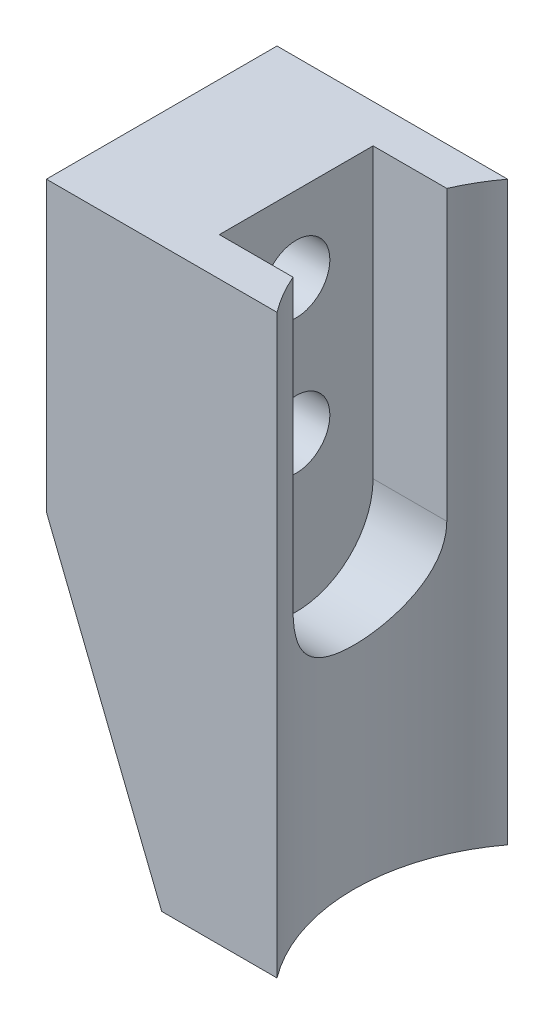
ISO-10303-21;
HEADER;
FILE_DESCRIPTION(('STEP AP214'),'2;1');
FILE_NAME('part.step','',(''),(''),'','','');
FILE_SCHEMA(('AUTOMOTIVE_DESIGN { 1 0 10303 214 1 1 1 1 }'));
ENDSEC;
DATA;
#1=APPLICATION_CONTEXT('core data for automotive mechanical design processes');
#2=APPLICATION_PROTOCOL_DEFINITION('international standard','automotive_design',2000,#1);
#3=PRODUCT_CONTEXT('',#1,'mechanical');
#4=PRODUCT('Part','Part','',(#3));
#5=PRODUCT_RELATED_PRODUCT_CATEGORY('part','',(#4));
#6=PRODUCT_DEFINITION_FORMATION('','',#4);
#7=PRODUCT_DEFINITION_CONTEXT('part definition',#1,'design');
#8=PRODUCT_DEFINITION('design','',#6,#7);
#9=PRODUCT_DEFINITION_SHAPE('','',#8);
#10=(LENGTH_UNIT() NAMED_UNIT(*) SI_UNIT(.MILLI.,.METRE.));
#11=(NAMED_UNIT(*) PLANE_ANGLE_UNIT() SI_UNIT($,.RADIAN.));
#12=(NAMED_UNIT(*) SI_UNIT($,.STERADIAN.) SOLID_ANGLE_UNIT());
#13=UNCERTAINTY_MEASURE_WITH_UNIT(LENGTH_MEASURE(1.E-05),#10,'distance_accuracy_value','');
#14=(GEOMETRIC_REPRESENTATION_CONTEXT(3) GLOBAL_UNCERTAINTY_ASSIGNED_CONTEXT((#13)) GLOBAL_UNIT_ASSIGNED_CONTEXT((#10,
#11,#12)) REPRESENTATION_CONTEXT('',''));
#15=CARTESIAN_POINT('',(0.,0.,0.));
#16=DIRECTION('',(0.,0.,1.));
#17=DIRECTION('',(1.,0.,0.));
#18=AXIS2_PLACEMENT_3D('',#15,#16,#17);
#19=CARTESIAN_POINT('',(-20.,3.99999999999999,6.));
#20=DIRECTION('',(1.,0.,0.));
#21=DIRECTION('',(0.,1.,0.));
#22=AXIS2_PLACEMENT_3D('',#19,#20,#21);
#23=CYLINDRICAL_SURFACE('',#22,1.75);
#24=CARTESIAN_POINT('',(-12.5,3.99999999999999,6.));
#25=DIRECTION('',(1.,0.,0.));
#26=DIRECTION('',(0.,1.,0.));
#27=AXIS2_PLACEMENT_3D('',#24,#25,#26);
#28=CIRCLE('',#27,1.75);
#29=CARTESIAN_POINT('',(-12.5,5.74999999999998,6.));
#30=VERTEX_POINT('',#29);
#31=EDGE_CURVE('E105',#30,#30,#28,.F.);
#32=ORIENTED_EDGE('',*,*,#31,.F.);
#33=EDGE_LOOP('',(#32));
#34=FACE_BOUND('',#33,.T.);
#35=CARTESIAN_POINT('',(-16.5,3.99999999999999,6.));
#36=DIRECTION('',(1.,0.,0.));
#37=DIRECTION('',(0.,1.,0.));
#38=AXIS2_PLACEMENT_3D('',#35,#36,#37);
#39=CIRCLE('',#38,1.75);
#40=CARTESIAN_POINT('',(-16.5,5.74999999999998,6.));
#41=VERTEX_POINT('',#40);
#42=EDGE_CURVE('E20',#41,#41,#39,.T.);
#43=ORIENTED_EDGE('',*,*,#42,.F.);
#44=EDGE_LOOP('',(#43));
#45=FACE_BOUND('',#44,.T.);
#46=ADVANCED_FACE('F17',(#34,#45),#23,.F.);
#47=CARTESIAN_POINT('',(-20.,11.,6.));
#48=DIRECTION('',(1.,0.,0.));
#49=DIRECTION('',(0.,1.,0.));
#50=AXIS2_PLACEMENT_3D('',#47,#48,#49);
#51=CYLINDRICAL_SURFACE('',#50,1.75);
#52=CARTESIAN_POINT('',(-12.5,11.,6.));
#53=DIRECTION('',(1.,0.,0.));
#54=DIRECTION('',(0.,1.,0.));
#55=AXIS2_PLACEMENT_3D('',#52,#53,#54);
#56=CIRCLE('',#55,1.75);
#57=CARTESIAN_POINT('',(-12.5,12.75,6.));
#58=VERTEX_POINT('',#57);
#59=EDGE_CURVE('E96',#58,#58,#56,.F.);
#60=ORIENTED_EDGE('',*,*,#59,.F.);
#61=EDGE_LOOP('',(#60));
#62=FACE_BOUND('',#61,.T.);
#63=CARTESIAN_POINT('',(-16.5,11.,6.));
#64=DIRECTION('',(1.,0.,0.));
#65=DIRECTION('',(0.,1.,0.));
#66=AXIS2_PLACEMENT_3D('',#63,#64,#65);
#67=CIRCLE('',#66,1.75);
#68=CARTESIAN_POINT('',(-16.5,12.75,6.));
#69=VERTEX_POINT('',#68);
#70=EDGE_CURVE('E106',#69,#69,#67,.T.);
#71=ORIENTED_EDGE('',*,*,#70,.F.);
#72=EDGE_LOOP('',(#71));
#73=FACE_BOUND('',#72,.T.);
#74=ADVANCED_FACE('F301',(#62,#73),#51,.F.);
#75=CARTESIAN_POINT('',(-16.5,3.99999999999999,6.));
#76=DIRECTION('',(-1.,0.,0.));
#77=DIRECTION('',(0.,-1.,0.));
#78=AXIS2_PLACEMENT_3D('',#75,#76,#77);
#79=PLANE('',#78);
#80=ORIENTED_EDGE('',*,*,#42,.T.);
#81=EDGE_LOOP('',(#80));
#82=FACE_BOUND('',#81,.T.);
#83=CARTESIAN_POINT('',(-16.5,3.99999999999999,6.));
#84=DIRECTION('',(-1.,0.,0.));
#85=DIRECTION('',(0.,-1.,0.));
#86=AXIS2_PLACEMENT_3D('',#83,#84,#85);
#87=CIRCLE('',#86,3.);
#88=CARTESIAN_POINT('',(-16.5,0.999999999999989,6.));
#89=VERTEX_POINT('',#88);
#90=EDGE_CURVE('E122',#89,#89,#87,.T.);
#91=ORIENTED_EDGE('',*,*,#90,.T.);
#92=EDGE_LOOP('',(#91));
#93=FACE_BOUND('',#92,.T.);
#94=ADVANCED_FACE('F298',(#82,#93),#79,.T.);
#95=CARTESIAN_POINT('',(-16.5,11.,6.));
#96=DIRECTION('',(-1.,0.,0.));
#97=DIRECTION('',(0.,-1.,0.));
#98=AXIS2_PLACEMENT_3D('',#95,#96,#97);
#99=PLANE('',#98);
#100=ORIENTED_EDGE('',*,*,#70,.T.);
#101=EDGE_LOOP('',(#100));
#102=FACE_BOUND('',#101,.T.);
#103=CARTESIAN_POINT('',(-16.5,11.,6.));
#104=DIRECTION('',(-1.,0.,0.));
#105=DIRECTION('',(0.,-1.,0.));
#106=AXIS2_PLACEMENT_3D('',#103,#104,#105);
#107=CIRCLE('',#106,3.);
#108=CARTESIAN_POINT('',(-16.5,7.99999999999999,6.));
#109=VERTEX_POINT('',#108);
#110=EDGE_CURVE('E150',#109,#109,#107,.T.);
#111=ORIENTED_EDGE('',*,*,#110,.T.);
#112=EDGE_LOOP('',(#111));
#113=FACE_BOUND('',#112,.T.);
#114=ADVANCED_FACE('F185',(#102,#113),#99,.T.);
#115=CARTESIAN_POINT('',(-12.5,0.,6.));
#116=DIRECTION('',(1.,0.,0.));
#117=DIRECTION('',(0.,1.,0.));
#118=AXIS2_PLACEMENT_3D('',#115,#116,#117);
#119=CYLINDRICAL_SURFACE('',#118,4.);
#120=CARTESIAN_POINT('',(-12.5,0.,6.));
#121=DIRECTION('',(1.,0.,0.));
#122=DIRECTION('',(0.,1.,0.));
#123=AXIS2_PLACEMENT_3D('',#120,#121,#122);
#124=CIRCLE('',#123,4.);
#125=CARTESIAN_POINT('',(-12.5,0.,10.));
#126=VERTEX_POINT('',#125);
#127=CARTESIAN_POINT('',(-12.5,0.,2.));
#128=VERTEX_POINT('',#127);
#129=EDGE_CURVE('E85',#126,#128,#124,.T.);
#130=ORIENTED_EDGE('',*,*,#129,.F.);
#131=DIRECTION('',(1.,0.,0.));
#132=VECTOR('',#131,1.);
#133=CARTESIAN_POINT('',(-12.5,0.,10.));
#134=LINE('',#133,#132);
#135=CARTESIAN_POINT('',(-8.66515138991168,0.,10.));
#136=VERTEX_POINT('',#135);
#137=EDGE_CURVE('E113',#126,#136,#134,.T.);
#138=ORIENTED_EDGE('',*,*,#137,.T.);
#139=CARTESIAN_POINT('',(-8.66515138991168,0.,10.));
#140=CARTESIAN_POINT('',(-8.66512928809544,-0.107611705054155,10.0000159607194));
#141=CARTESIAN_POINT('',(-8.66704612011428,-0.215211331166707,9.99565782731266));
#142=CARTESIAN_POINT('',(-8.67459250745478,-0.429542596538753,9.9783181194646));
#143=CARTESIAN_POINT('',(-8.68022064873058,-0.536274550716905,9.96533982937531));
#144=CARTESIAN_POINT('',(-8.69499565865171,-0.747693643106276,9.93095207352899));
#145=CARTESIAN_POINT('',(-8.70412861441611,-0.852387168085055,9.90957593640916));
#146=CARTESIAN_POINT('',(-8.72560106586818,-1.05940154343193,9.85863260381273));
#147=CARTESIAN_POINT('',(-8.73794075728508,-1.16172224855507,9.82906490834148));
#148=CARTESIAN_POINT('',(-8.7791858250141,-1.46387170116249,9.72853943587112));
#149=CARTESIAN_POINT('',(-8.8123489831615,-1.65930846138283,9.64568978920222));
#150=CARTESIAN_POINT('',(-8.88624741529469,-2.03359116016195,9.45096383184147));
#151=CARTESIAN_POINT('',(-8.92698987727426,-2.21242110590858,9.33905992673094));
#152=CARTESIAN_POINT('',(-9.01401998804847,-2.55852479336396,9.08263671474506));
#153=CARTESIAN_POINT('',(-9.06048491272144,-2.7247344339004,8.936738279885));
#154=CARTESIAN_POINT('',(-9.15225581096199,-3.03108054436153,8.61939292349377));
#155=CARTESIAN_POINT('',(-9.19756154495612,-3.1712116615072,8.44794076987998));
#156=CARTESIAN_POINT('',(-9.28406834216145,-3.42681278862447,8.07601181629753));
#157=CARTESIAN_POINT('',(-9.32503649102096,-3.54108961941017,7.87465586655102));
#158=CARTESIAN_POINT('',(-9.39607888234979,-3.73368814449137,7.45364828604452));
#159=CARTESIAN_POINT('',(-9.42615767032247,-3.81202484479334,7.23400433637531));
#160=CARTESIAN_POINT('',(-9.47076629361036,-3.92668240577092,6.79393488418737));
#161=CARTESIAN_POINT('',(-9.48597845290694,-3.96485391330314,6.57406211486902));
#162=CARTESIAN_POINT('',(-9.501606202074,-4.00405694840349,6.1305368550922));
#163=CARTESIAN_POINT('',(-9.5020270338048,-4.00510163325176,5.90688573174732));
#164=CARTESIAN_POINT('',(-9.48843920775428,-3.97103436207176,5.47553326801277));
#165=CARTESIAN_POINT('',(-9.47523973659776,-3.93795005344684,5.26764166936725));
#166=CARTESIAN_POINT('',(-9.43698538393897,-3.84001299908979,4.86065035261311));
#167=CARTESIAN_POINT('',(-9.41192983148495,-3.77515845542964,4.66155113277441));
#168=CARTESIAN_POINT('',(-9.35193670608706,-3.61472796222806,4.27420520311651));
#169=CARTESIAN_POINT('',(-9.31685584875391,-3.51870360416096,4.08616735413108));
#170=CARTESIAN_POINT('',(-9.24029168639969,-3.29906873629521,3.72838400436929));
#171=CARTESIAN_POINT('',(-9.19880613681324,-3.17544854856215,3.5586449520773));
#172=CARTESIAN_POINT('',(-9.11043706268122,-2.89471994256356,3.2304774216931));
#173=CARTESIAN_POINT('',(-9.06337795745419,-2.7359469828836,3.07352077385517));
#174=CARTESIAN_POINT('',(-8.97123359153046,-2.39400786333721,2.7877852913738));
#175=CARTESIAN_POINT('',(-8.92614923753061,-2.2108306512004,2.65901929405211));
#176=CARTESIAN_POINT('',(-8.86326134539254,-1.9183643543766,2.48813865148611));
#177=CARTESIAN_POINT('',(-8.84283170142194,-1.81632816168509,2.43428736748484));
#178=CARTESIAN_POINT('',(-8.80450957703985,-1.60760769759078,2.3354523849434));
#179=CARTESIAN_POINT('',(-8.78661600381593,-1.5009254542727,2.29046486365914));
#180=CARTESIAN_POINT('',(-8.7540025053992,-1.28377106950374,2.20983745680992));
#181=CARTESIAN_POINT('',(-8.7392786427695,-1.17330382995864,2.17418596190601));
#182=CARTESIAN_POINT('',(-8.7135146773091,-0.949331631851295,2.11255151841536));
#183=CARTESIAN_POINT('',(-8.70247292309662,-0.83582805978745,2.08656423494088));
#184=CARTESIAN_POINT('',(-8.68417798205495,-0.602554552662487,2.04380606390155));
#185=CARTESIAN_POINT('',(-8.67707470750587,-0.482705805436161,2.02739874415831));
#186=CARTESIAN_POINT('',(-8.66754485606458,-0.241909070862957,2.00548551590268));
#187=CARTESIAN_POINT('',(-8.66511539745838,-0.120961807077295,1.9999728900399));
#188=CARTESIAN_POINT('',(-8.66515138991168,0.,2.));
#189=B_SPLINE_CURVE_WITH_KNOTS('',3,(#139,#140,#141,#142,#143,#144,#145,#146,#147,#148,#149,
#150,#151,#152,#153,#154,#155,#156,#157,#158,#159,#160,#161,#162,#163,#164,#165,#166,#167,#168,
#169,#170,#171,#172,#173,#174,#175,#176,#177,#178,#179,#180,#181,#182,#183,#184,#185,#186,#187,
#188),.UNSPECIFIED.,.F.,.F.,(4,2,2,2,2,2,2,2,2,2,2,2,2,2,2,2,2,2,2,2,2,2,2,2,4),(0.,
0.322709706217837,0.645296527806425,0.966615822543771,1.28795473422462,1.9293660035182,
2.57138869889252,3.24636095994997,3.92147161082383,4.62325717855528,5.32474946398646,
5.9922775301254,6.65956903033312,7.28937830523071,7.91922322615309,8.55856353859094,
9.19812842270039,9.87963749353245,10.5614562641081,10.9125878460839,11.2635676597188,
11.614108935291,11.964492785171,12.3274303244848,12.6901440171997),.UNSPECIFIED.);
#190=CARTESIAN_POINT('',(-8.66515138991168,0.,2.));
#191=VERTEX_POINT('',#190);
#192=EDGE_CURVE('E102',#136,#191,#189,.T.);
#193=ORIENTED_EDGE('',*,*,#192,.T.);
#194=DIRECTION('',(1.,0.,0.));
#195=VECTOR('',#194,1.);
#196=CARTESIAN_POINT('',(-12.5,0.,2.));
#197=LINE('',#196,#195);
#198=EDGE_CURVE('E99',#191,#128,#197,.F.);
#199=ORIENTED_EDGE('',*,*,#198,.T.);
#200=EDGE_LOOP('',(#130,#138,#193,#199));
#201=FACE_BOUND('',#200,.T.);
#202=ADVANCED_FACE('F100',(#201),#119,.F.);
#203=CARTESIAN_POINT('',(-12.5,15.,2.));
#204=DIRECTION('',(0.,0.,-1.));
#205=DIRECTION('',(0.,1.,0.));
#206=AXIS2_PLACEMENT_3D('',#203,#204,#205);
#207=PLANE('',#206);
#208=DIRECTION('',(0.,-1.,0.));
#209=VECTOR('',#208,1.);
#210=CARTESIAN_POINT('',(-8.66515138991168,28.2842712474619,2.));
#211=LINE('',#210,#209);
#212=CARTESIAN_POINT('',(-8.66515138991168,15.,2.));
#213=VERTEX_POINT('',#212);
#214=EDGE_CURVE('E142',#191,#213,#211,.F.);
#215=ORIENTED_EDGE('',*,*,#214,.T.);
#216=DIRECTION('',(1.,0.,0.));
#217=VECTOR('',#216,1.);
#218=CARTESIAN_POINT('',(-20.,15.,2.));
#219=LINE('',#218,#217);
#220=CARTESIAN_POINT('',(-12.5,15.,2.));
#221=VERTEX_POINT('',#220);
#222=EDGE_CURVE('E111',#213,#221,#219,.F.);
#223=ORIENTED_EDGE('',*,*,#222,.T.);
#224=DIRECTION('',(0.,1.,0.));
#225=VECTOR('',#224,1.);
#226=CARTESIAN_POINT('',(-12.5,15.,2.));
#227=LINE('',#226,#225);
#228=EDGE_CURVE('E93',#128,#221,#227,.T.);
#229=ORIENTED_EDGE('',*,*,#228,.F.);
#230=ORIENTED_EDGE('',*,*,#198,.F.);
#231=EDGE_LOOP('',(#215,#223,#229,#230));
#232=FACE_BOUND('',#231,.T.);
#233=ADVANCED_FACE('F109',(#232),#207,.F.);
#234=CARTESIAN_POINT('',(-12.5,15.,6.));
#235=DIRECTION('',(1.,0.,0.));
#236=DIRECTION('',(0.,1.,0.));
#237=AXIS2_PLACEMENT_3D('',#234,#235,#236);
#238=PLANE('',#237);
#239=ORIENTED_EDGE('',*,*,#129,.T.);
#240=ORIENTED_EDGE('',*,*,#228,.T.);
#241=DIRECTION('',(0.,0.,-1.));
#242=VECTOR('',#241,1.);
#243=CARTESIAN_POINT('',(-12.5,15.,12.));
#244=LINE('',#243,#242);
#245=CARTESIAN_POINT('',(-12.5,15.,10.));
#246=VERTEX_POINT('',#245);
#247=EDGE_CURVE('E249',#221,#246,#244,.F.);
#248=ORIENTED_EDGE('',*,*,#247,.T.);
#249=DIRECTION('',(0.,-1.,0.));
#250=VECTOR('',#249,1.);
#251=CARTESIAN_POINT('',(-12.5,15.,10.));
#252=LINE('',#251,#250);
#253=EDGE_CURVE('E95',#246,#126,#252,.T.);
#254=ORIENTED_EDGE('',*,*,#253,.T.);
#255=EDGE_LOOP('',(#239,#240,#248,#254));
#256=FACE_BOUND('',#255,.T.);
#257=ORIENTED_EDGE('',*,*,#59,.T.);
#258=EDGE_LOOP('',(#257));
#259=FACE_BOUND('',#258,.T.);
#260=ORIENTED_EDGE('',*,*,#31,.T.);
#261=EDGE_LOOP('',(#260));
#262=FACE_BOUND('',#261,.T.);
#263=ADVANCED_FACE('F89',(#256,#259,#262),#238,.T.);
#264=CARTESIAN_POINT('',(-12.5,15.,10.));
#265=DIRECTION('',(0.,0.,1.));
#266=DIRECTION('',(0.,-1.,0.));
#267=AXIS2_PLACEMENT_3D('',#264,#265,#266);
#268=PLANE('',#267);
#269=DIRECTION('',(0.,-1.,0.));
#270=VECTOR('',#269,1.);
#271=CARTESIAN_POINT('',(-8.66515138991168,28.2842712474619,10.));
#272=LINE('',#271,#270);
#273=CARTESIAN_POINT('',(-8.66515138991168,15.,10.));
#274=VERTEX_POINT('',#273);
#275=EDGE_CURVE('E149',#274,#136,#272,.T.);
#276=ORIENTED_EDGE('',*,*,#275,.T.);
#277=ORIENTED_EDGE('',*,*,#137,.F.);
#278=ORIENTED_EDGE('',*,*,#253,.F.);
#279=DIRECTION('',(1.,0.,0.));
#280=VECTOR('',#279,1.);
#281=CARTESIAN_POINT('',(-20.,15.,10.));
#282=LINE('',#281,#280);
#283=EDGE_CURVE('E138',#246,#274,#282,.T.);
#284=ORIENTED_EDGE('',*,*,#283,.T.);
#285=EDGE_LOOP('',(#276,#277,#278,#284));
#286=FACE_BOUND('',#285,.T.);
#287=ADVANCED_FACE('F174',(#286),#268,.F.);
#288=CARTESIAN_POINT('',(-16.5,3.99999999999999,6.));
#289=DIRECTION('',(-1.,0.,0.));
#290=DIRECTION('',(0.,-1.,0.));
#291=AXIS2_PLACEMENT_3D('',#288,#289,#290);
#292=CYLINDRICAL_SURFACE('',#291,3.);
#293=ORIENTED_EDGE('',*,*,#90,.F.);
#294=EDGE_LOOP('',(#293));
#295=FACE_BOUND('',#294,.T.);
#296=CARTESIAN_POINT('',(-19.5,3.99999999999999,6.));
#297=DIRECTION('',(-1.,0.,0.));
#298=DIRECTION('',(0.,-1.,0.));
#299=AXIS2_PLACEMENT_3D('',#296,#297,#298);
#300=CIRCLE('',#299,3.);
#301=CARTESIAN_POINT('',(-19.5,0.999999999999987,6.));
#302=VERTEX_POINT('',#301);
#303=EDGE_CURVE('E131',#302,#302,#300,.T.);
#304=ORIENTED_EDGE('',*,*,#303,.T.);
#305=EDGE_LOOP('',(#304));
#306=FACE_BOUND('',#305,.T.);
#307=ADVANCED_FACE('F170',(#295,#306),#292,.F.);
#308=CARTESIAN_POINT('',(-16.5,11.,6.));
#309=DIRECTION('',(-1.,0.,0.));
#310=DIRECTION('',(0.,-1.,0.));
#311=AXIS2_PLACEMENT_3D('',#308,#309,#310);
#312=CYLINDRICAL_SURFACE('',#311,3.);
#313=ORIENTED_EDGE('',*,*,#110,.F.);
#314=EDGE_LOOP('',(#313));
#315=FACE_BOUND('',#314,.T.);
#316=CARTESIAN_POINT('',(-19.5,11.,6.));
#317=DIRECTION('',(-1.,0.,0.));
#318=DIRECTION('',(0.,-1.,0.));
#319=AXIS2_PLACEMENT_3D('',#316,#317,#318);
#320=CIRCLE('',#319,3.);
#321=CARTESIAN_POINT('',(-19.5,7.99999999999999,6.));
#322=VERTEX_POINT('',#321);
#323=EDGE_CURVE('E127',#322,#322,#320,.T.);
#324=ORIENTED_EDGE('',*,*,#323,.T.);
#325=EDGE_LOOP('',(#324));
#326=FACE_BOUND('',#325,.T.);
#327=ADVANCED_FACE('F166',(#315,#326),#312,.F.);
#328=CARTESIAN_POINT('',(0.,0.,12.));
#329=DIRECTION('',(0.,0.,1.));
#330=DIRECTION('',(1.,0.,0.));
#331=AXIS2_PLACEMENT_3D('',#328,#329,#330);
#332=PLANE('',#331);
#333=DIRECTION('',(1.,0.,0.));
#334=VECTOR('',#333,1.);
#335=CARTESIAN_POINT('',(-20.,15.,12.));
#336=LINE('',#335,#334);
#337=CARTESIAN_POINT('',(-7.5,15.,12.));
#338=VERTEX_POINT('',#337);
#339=CARTESIAN_POINT('',(-19.5,15.,12.));
#340=VERTEX_POINT('',#339);
#341=EDGE_CURVE('E134',#338,#340,#336,.F.);
#342=ORIENTED_EDGE('',*,*,#341,.T.);
#343=DIRECTION('',(0.,1.,0.));
#344=VECTOR('',#343,1.);
#345=CARTESIAN_POINT('',(-19.5,0.,12.));
#346=LINE('',#345,#344);
#347=CARTESIAN_POINT('',(-19.5,0.,12.));
#348=VERTEX_POINT('',#347);
#349=EDGE_CURVE('E217',#340,#348,#346,.F.);
#350=ORIENTED_EDGE('',*,*,#349,.T.);
#351=DIRECTION('',(-0.371390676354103,0.928476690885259,0.));
#352=VECTOR('',#351,1.);
#353=CARTESIAN_POINT('',(-19.5,0.,12.));
#354=LINE('',#353,#352);
#355=CARTESIAN_POINT('',(-13.5,-15.,12.));
#356=VERTEX_POINT('',#355);
#357=EDGE_CURVE('E126',#348,#356,#354,.F.);
#358=ORIENTED_EDGE('',*,*,#357,.T.);
#359=DIRECTION('',(1.,0.,0.));
#360=VECTOR('',#359,1.);
#361=CARTESIAN_POINT('',(-20.,-15.,12.));
#362=LINE('',#361,#360);
#363=CARTESIAN_POINT('',(-7.5,-15.,12.));
#364=VERTEX_POINT('',#363);
#365=EDGE_CURVE('E274',#356,#364,#362,.T.);
#366=ORIENTED_EDGE('',*,*,#365,.T.);
#367=DIRECTION('',(0.,-1.,0.));
#368=VECTOR('',#367,1.);
#369=CARTESIAN_POINT('',(-7.5,28.2842712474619,12.));
#370=LINE('',#369,#368);
#371=EDGE_CURVE('E257',#364,#338,#370,.F.);
#372=ORIENTED_EDGE('',*,*,#371,.T.);
#373=EDGE_LOOP('',(#342,#350,#358,#366,#372));
#374=FACE_BOUND('',#373,.T.);
#375=ADVANCED_FACE('F161',(#374),#332,.T.);
#376=CARTESIAN_POINT('',(0.500000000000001,28.2842712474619,6.));
#377=DIRECTION('',(0.,-1.,0.));
#378=DIRECTION('',(0.,0.,-1.));
#379=AXIS2_PLACEMENT_3D('',#376,#377,#378);
#380=CYLINDRICAL_SURFACE('',#379,10.);
#381=DIRECTION('',(0.,1.,0.));
#382=VECTOR('',#381,1.);
#383=CARTESIAN_POINT('',(-7.5,0.,0.));
#384=LINE('',#383,#382);
#385=CARTESIAN_POINT('',(-7.5,-15.,0.));
#386=VERTEX_POINT('',#385);
#387=CARTESIAN_POINT('',(-7.5,15.,0.));
#388=VERTEX_POINT('',#387);
#389=EDGE_CURVE('E241',#386,#388,#384,.T.);
#390=ORIENTED_EDGE('',*,*,#389,.T.);
#391=CARTESIAN_POINT('',(0.500000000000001,15.,6.));
#392=DIRECTION('',(0.,-1.,0.));
#393=DIRECTION('',(0.,0.,-1.));
#394=AXIS2_PLACEMENT_3D('',#391,#392,#393);
#395=CIRCLE('',#394,10.);
#396=EDGE_CURVE('E139',#388,#213,#395,.F.);
#397=ORIENTED_EDGE('',*,*,#396,.T.);
#398=ORIENTED_EDGE('',*,*,#214,.F.);
#399=ORIENTED_EDGE('',*,*,#192,.F.);
#400=ORIENTED_EDGE('',*,*,#275,.F.);
#401=CARTESIAN_POINT('',(0.500000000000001,15.,6.));
#402=DIRECTION('',(0.,-1.,0.));
#403=DIRECTION('',(0.,0.,-1.));
#404=AXIS2_PLACEMENT_3D('',#401,#402,#403);
#405=CIRCLE('',#404,10.);
#406=EDGE_CURVE('E135',#274,#338,#405,.F.);
#407=ORIENTED_EDGE('',*,*,#406,.T.);
#408=ORIENTED_EDGE('',*,*,#371,.F.);
#409=CARTESIAN_POINT('',(0.500000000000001,-15.,6.));
#410=DIRECTION('',(0.,-1.,0.));
#411=DIRECTION('',(0.,0.,-1.));
#412=AXIS2_PLACEMENT_3D('',#409,#410,#411);
#413=CIRCLE('',#412,10.);
#414=EDGE_CURVE('E123',#364,#386,#413,.T.);
#415=ORIENTED_EDGE('',*,*,#414,.T.);
#416=EDGE_LOOP('',(#390,#397,#398,#399,#400,#407,#408,#415));
#417=FACE_BOUND('',#416,.T.);
#418=ADVANCED_FACE('F155',(#417),#380,.F.);
#419=CARTESIAN_POINT('',(-20.,15.,12.));
#420=DIRECTION('',(0.,-1.,0.));
#421=DIRECTION('',(0.,0.,-1.));
#422=AXIS2_PLACEMENT_3D('',#419,#420,#421);
#423=PLANE('',#422);
#424=ORIENTED_EDGE('',*,*,#406,.F.);
#425=ORIENTED_EDGE('',*,*,#283,.F.);
#426=ORIENTED_EDGE('',*,*,#247,.F.);
#427=ORIENTED_EDGE('',*,*,#222,.F.);
#428=ORIENTED_EDGE('',*,*,#396,.F.);
#429=DIRECTION('',(1.,0.,0.));
#430=VECTOR('',#429,1.);
#431=CARTESIAN_POINT('',(0.,15.,0.));
#432=LINE('',#431,#430);
#433=CARTESIAN_POINT('',(-19.5,15.,0.));
#434=VERTEX_POINT('',#433);
#435=EDGE_CURVE('E233',#388,#434,#432,.F.);
#436=ORIENTED_EDGE('',*,*,#435,.T.);
#437=DIRECTION('',(0.,0.,1.));
#438=VECTOR('',#437,1.);
#439=CARTESIAN_POINT('',(-19.5,15.,0.));
#440=LINE('',#439,#438);
#441=EDGE_CURVE('E130',#434,#340,#440,.T.);
#442=ORIENTED_EDGE('',*,*,#441,.T.);
#443=ORIENTED_EDGE('',*,*,#341,.F.);
#444=EDGE_LOOP('',(#424,#425,#426,#427,#428,#436,#442,#443));
#445=FACE_BOUND('',#444,.T.);
#446=ADVANCED_FACE('F160',(#445),#423,.F.);
#447=CARTESIAN_POINT('',(-19.5,0.,0.));
#448=DIRECTION('',(1.,0.,0.));
#449=DIRECTION('',(0.,1.,0.));
#450=AXIS2_PLACEMENT_3D('',#447,#448,#449);
#451=PLANE('',#450);
#452=DIRECTION('',(0.,0.,1.));
#453=VECTOR('',#452,1.);
#454=CARTESIAN_POINT('',(-19.5,0.,12.));
#455=LINE('',#454,#453);
#456=CARTESIAN_POINT('',(-19.5,0.,0.));
#457=VERTEX_POINT('',#456);
#458=EDGE_CURVE('E211',#457,#348,#455,.T.);
#459=ORIENTED_EDGE('',*,*,#458,.T.);
#460=ORIENTED_EDGE('',*,*,#349,.F.);
#461=ORIENTED_EDGE('',*,*,#441,.F.);
#462=DIRECTION('',(0.,1.,0.));
#463=VECTOR('',#462,1.);
#464=CARTESIAN_POINT('',(-19.5,0.,0.));
#465=LINE('',#464,#463);
#466=EDGE_CURVE('E220',#434,#457,#465,.F.);
#467=ORIENTED_EDGE('',*,*,#466,.T.);
#468=EDGE_LOOP('',(#459,#460,#461,#467));
#469=FACE_BOUND('',#468,.T.);
#470=ORIENTED_EDGE('',*,*,#323,.F.);
#471=EDGE_LOOP('',(#470));
#472=FACE_BOUND('',#471,.T.);
#473=ORIENTED_EDGE('',*,*,#303,.F.);
#474=EDGE_LOOP('',(#473));
#475=FACE_BOUND('',#474,.T.);
#476=ADVANCED_FACE('F199',(#469,#472,#475),#451,.F.);
#477=CARTESIAN_POINT('',(-19.5,0.,12.));
#478=DIRECTION('',(0.928476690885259,0.371390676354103,0.));
#479=DIRECTION('',(-0.371390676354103,0.928476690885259,0.));
#480=AXIS2_PLACEMENT_3D('',#477,#478,#479);
#481=PLANE('',#480);
#482=DIRECTION('',(0.,0.,1.));
#483=VECTOR('',#482,1.);
#484=CARTESIAN_POINT('',(-13.5,-15.,12.));
#485=LINE('',#484,#483);
#486=CARTESIAN_POINT('',(-13.5,-15.,0.));
#487=VERTEX_POINT('',#486);
#488=EDGE_CURVE('E34',#487,#356,#485,.T.);
#489=ORIENTED_EDGE('',*,*,#488,.T.);
#490=ORIENTED_EDGE('',*,*,#357,.F.);
#491=ORIENTED_EDGE('',*,*,#458,.F.);
#492=DIRECTION('',(0.371390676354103,-0.928476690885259,0.));
#493=VECTOR('',#492,1.);
#494=CARTESIAN_POINT('',(-19.5,0.,0.));
#495=LINE('',#494,#493);
#496=EDGE_CURVE('E26',#457,#487,#495,.T.);
#497=ORIENTED_EDGE('',*,*,#496,.T.);
#498=EDGE_LOOP('',(#489,#490,#491,#497));
#499=FACE_BOUND('',#498,.T.);
#500=ADVANCED_FACE('F194',(#499),#481,.F.);
#501=CARTESIAN_POINT('',(-20.,-15.,12.));
#502=DIRECTION('',(0.,1.,0.));
#503=DIRECTION('',(0.,0.,1.));
#504=AXIS2_PLACEMENT_3D('',#501,#502,#503);
#505=PLANE('',#504);
#506=ORIENTED_EDGE('',*,*,#488,.F.);
#507=DIRECTION('',(1.,0.,0.));
#508=VECTOR('',#507,1.);
#509=CARTESIAN_POINT('',(0.,-15.,0.));
#510=LINE('',#509,#508);
#511=EDGE_CURVE('E11',#487,#386,#510,.T.);
#512=ORIENTED_EDGE('',*,*,#511,.T.);
#513=ORIENTED_EDGE('',*,*,#414,.F.);
#514=ORIENTED_EDGE('',*,*,#365,.F.);
#515=EDGE_LOOP('',(#506,#512,#513,#514));
#516=FACE_BOUND('',#515,.T.);
#517=ADVANCED_FACE('F188',(#516),#505,.F.);
#518=CARTESIAN_POINT('',(0.,0.,0.));
#519=DIRECTION('',(0.,0.,1.));
#520=DIRECTION('',(1.,0.,0.));
#521=AXIS2_PLACEMENT_3D('',#518,#519,#520);
#522=PLANE('',#521);
#523=ORIENTED_EDGE('',*,*,#496,.F.);
#524=ORIENTED_EDGE('',*,*,#466,.F.);
#525=ORIENTED_EDGE('',*,*,#435,.F.);
#526=ORIENTED_EDGE('',*,*,#389,.F.);
#527=ORIENTED_EDGE('',*,*,#511,.F.);
#528=EDGE_LOOP('',(#523,#524,#525,#526,#527));
#529=FACE_BOUND('',#528,.T.);
#530=ADVANCED_FACE('F186',(#529),#522,.F.);
#531=CLOSED_SHELL('',(#46,#74,#94,#114,#202,#233,#263,#287,#307,#327,#375,#418,#446,#476,#500,
#517,#530));
#532=MANIFOLD_SOLID_BREP('B1',#531);
#533=ADVANCED_BREP_SHAPE_REPRESENTATION('',(#18,#532),#14);
#534=SHAPE_DEFINITION_REPRESENTATION(#9,#533);
ENDSEC;
END-ISO-10303-21;
